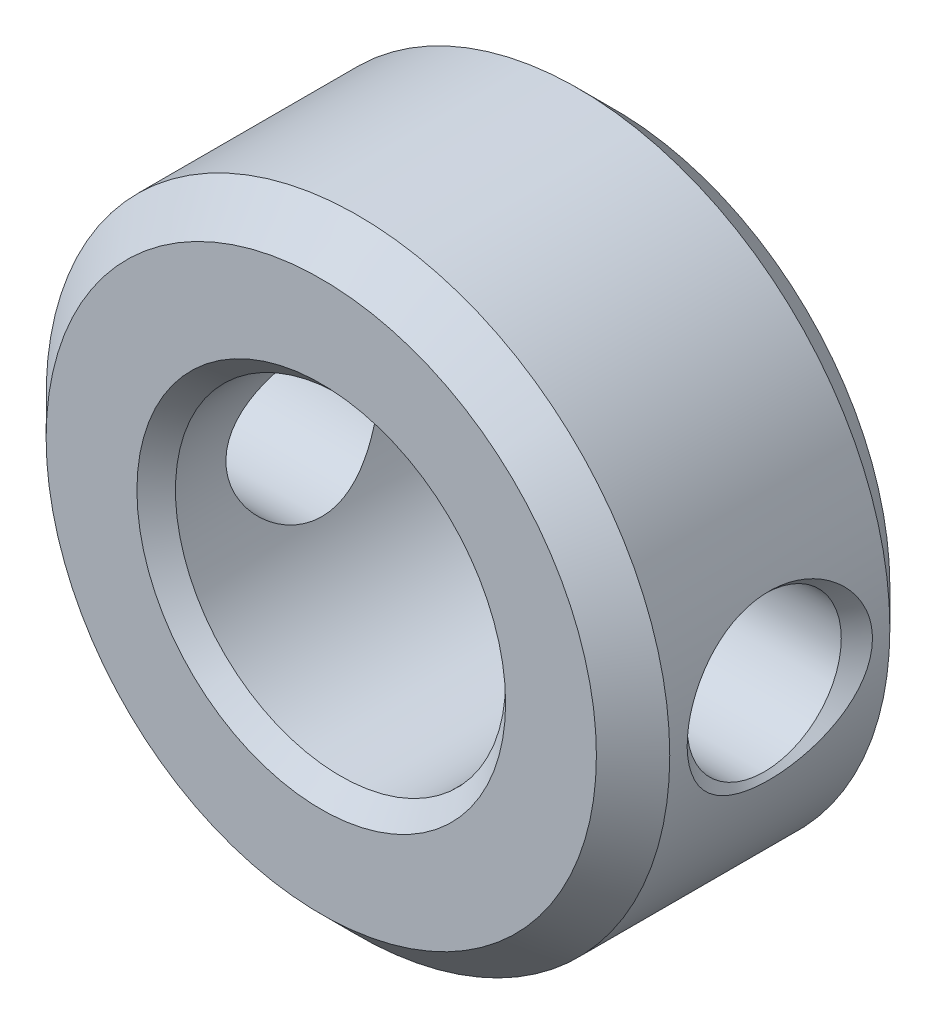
ISO-10303-21;
HEADER;
FILE_DESCRIPTION(('STEP AP214'),'2;1');
FILE_NAME('part.step','',(''),(''),'','','');
FILE_SCHEMA(('AUTOMOTIVE_DESIGN { 1 0 10303 214 1 1 1 1 }'));
ENDSEC;
DATA;
#1=APPLICATION_CONTEXT('core data for automotive mechanical design processes');
#2=APPLICATION_PROTOCOL_DEFINITION('international standard','automotive_design',2000,#1);
#3=PRODUCT_CONTEXT('',#1,'mechanical');
#4=PRODUCT('Part','Part','',(#3));
#5=PRODUCT_RELATED_PRODUCT_CATEGORY('part','',(#4));
#6=PRODUCT_DEFINITION_FORMATION('','',#4);
#7=PRODUCT_DEFINITION_CONTEXT('part definition',#1,'design');
#8=PRODUCT_DEFINITION('design','',#6,#7);
#9=PRODUCT_DEFINITION_SHAPE('','',#8);
#10=(LENGTH_UNIT() NAMED_UNIT(*) SI_UNIT(.MILLI.,.METRE.));
#11=(NAMED_UNIT(*) PLANE_ANGLE_UNIT() SI_UNIT($,.RADIAN.));
#12=(NAMED_UNIT(*) SI_UNIT($,.STERADIAN.) SOLID_ANGLE_UNIT());
#13=UNCERTAINTY_MEASURE_WITH_UNIT(LENGTH_MEASURE(1.E-05),#10,'distance_accuracy_value','');
#14=(GEOMETRIC_REPRESENTATION_CONTEXT(3) GLOBAL_UNCERTAINTY_ASSIGNED_CONTEXT((#13)) GLOBAL_UNIT_ASSIGNED_CONTEXT((#10,
#11,#12)) REPRESENTATION_CONTEXT('',''));
#15=CARTESIAN_POINT('',(0.,0.,0.));
#16=DIRECTION('',(0.,0.,1.));
#17=DIRECTION('',(1.,0.,0.));
#18=AXIS2_PLACEMENT_3D('',#15,#16,#17);
#19=CARTESIAN_POINT('',(0.,0.,8.));
#20=DIRECTION('',(0.,0.,-1.));
#21=DIRECTION('',(-1.,0.,0.));
#22=AXIS2_PLACEMENT_3D('',#19,#20,#21);
#23=CYLINDRICAL_SURFACE('',#22,8.5);
#24=CARTESIAN_POINT('',(-8.33916599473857,-1.64569455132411,2.30265787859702));
#25=CARTESIAN_POINT('',(-8.35352873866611,-1.5729086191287,2.21207653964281));
#26=CARTESIAN_POINT('',(-8.3681653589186,-1.49374170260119,2.1266935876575));
#27=CARTESIAN_POINT('',(-8.39677857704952,-1.32346522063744,1.96856182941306));
#28=CARTESIAN_POINT('',(-8.41075510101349,-1.23235432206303,1.89581443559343));
#29=CARTESIAN_POINT('',(-8.43857211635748,-1.02604069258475,1.75639125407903));
#30=CARTESIAN_POINT('',(-8.4521224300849,-0.909249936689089,1.69197300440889));
#31=CARTESIAN_POINT('',(-8.47482320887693,-0.665078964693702,1.58664198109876));
#32=CARTESIAN_POINT('',(-8.48397688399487,-0.537706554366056,1.54571205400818));
#33=CARTESIAN_POINT('',(-8.49568512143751,-0.293768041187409,1.49380051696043));
#34=CARTESIAN_POINT('',(-8.49893425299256,-0.177904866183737,1.47965677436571));
#35=CARTESIAN_POINT('',(-8.50061776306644,0.0544897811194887,1.47229961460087));
#36=CARTESIAN_POINT('',(-8.49905475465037,0.171020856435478,1.47907483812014));
#37=CARTESIAN_POINT('',(-8.49162408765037,0.391923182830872,1.51177200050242));
#38=CARTESIAN_POINT('',(-8.48609914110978,0.496537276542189,1.53617064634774));
#39=CARTESIAN_POINT('',(-8.47171529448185,0.700345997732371,1.6011473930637));
#40=CARTESIAN_POINT('',(-8.46285597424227,0.799539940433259,1.64172753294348));
#41=CARTESIAN_POINT('',(-8.44222788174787,0.99438229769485,1.73932031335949));
#42=CARTESIAN_POINT('',(-8.4303529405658,1.08970901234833,1.79694912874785));
#43=CARTESIAN_POINT('',(-8.40500514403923,1.27052787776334,1.925667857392));
#44=CARTESIAN_POINT('',(-8.39153164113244,1.35601601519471,1.99676323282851));
#45=CARTESIAN_POINT('',(-8.36245668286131,1.52564530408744,2.15947500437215));
#46=CARTESIAN_POINT('',(-8.34679383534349,1.60839490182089,2.25252997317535));
#47=CARTESIAN_POINT('',(-8.31632879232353,1.75914786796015,2.45001940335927));
#48=CARTESIAN_POINT('',(-8.30152704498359,1.82714360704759,2.55445971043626));
#49=CARTESIAN_POINT('',(-8.27235638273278,1.95524349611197,2.78582569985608));
#50=CARTESIAN_POINT('',(-8.25827400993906,2.01329177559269,2.91392914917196));
#51=CARTESIAN_POINT('',(-8.23432846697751,2.10909388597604,3.17788487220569));
#52=CARTESIAN_POINT('',(-8.22446670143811,2.1468409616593,3.31373970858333));
#53=CARTESIAN_POINT('',(-8.20948285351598,2.20348191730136,3.59970989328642));
#54=CARTESIAN_POINT('',(-8.20474827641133,2.22084191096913,3.75015184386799));
#55=CARTESIAN_POINT('',(-8.2018842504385,2.23139451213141,4.05194839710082));
#56=CARTESIAN_POINT('',(-8.20375569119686,2.2245838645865,4.20330311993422));
#57=CARTESIAN_POINT('',(-8.2139681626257,2.18657738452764,4.50537141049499));
#58=CARTESIAN_POINT('',(-8.2224202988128,2.1549627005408,4.65602882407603));
#59=CARTESIAN_POINT('',(-8.24488809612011,2.06732983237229,4.9496862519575));
#60=CARTESIAN_POINT('',(-8.25890484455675,2.01130687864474,5.09268476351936));
#61=CARTESIAN_POINT('',(-8.29061921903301,1.87626998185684,5.3654383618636));
#62=CARTESIAN_POINT('',(-8.30828426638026,1.79745721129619,5.49529645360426));
#63=CARTESIAN_POINT('',(-8.34512776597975,1.6177832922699,5.73862022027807));
#64=CARTESIAN_POINT('',(-8.36430600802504,1.51692520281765,5.85208816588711));
#65=CARTESIAN_POINT('',(-8.40035838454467,1.30195396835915,6.05111571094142));
#66=CARTESIAN_POINT('',(-8.41730160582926,1.18906458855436,6.13797706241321));
#67=CARTESIAN_POINT('',(-8.44781674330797,0.948172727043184,6.28815050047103));
#68=CARTESIAN_POINT('',(-8.46139330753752,0.820191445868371,6.35149511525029));
#69=CARTESIAN_POINT('',(-8.48155598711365,0.571495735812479,6.4436182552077));
#70=CARTESIAN_POINT('',(-8.48883938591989,0.452141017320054,6.47591403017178));
#71=CARTESIAN_POINT('',(-8.49828718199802,0.209320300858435,6.51759305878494));
#72=CARTESIAN_POINT('',(-8.50045611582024,0.0858580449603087,6.52699661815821));
#73=CARTESIAN_POINT('',(-8.49944227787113,-0.146246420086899,6.52256027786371));
#74=CARTESIAN_POINT('',(-8.49685000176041,-0.254949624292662,6.51128523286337));
#75=CARTESIAN_POINT('',(-8.48773555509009,-0.46882759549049,6.47100322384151));
#76=CARTESIAN_POINT('',(-8.48121350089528,-0.574002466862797,6.44199678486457));
#77=CARTESIAN_POINT('',(-8.46494812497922,-0.777887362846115,6.36778750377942));
#78=CARTESIAN_POINT('',(-8.4552119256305,-0.876611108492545,6.32262045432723));
#79=CARTESIAN_POINT('',(-8.43344706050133,-1.06586094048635,6.2179912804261));
#80=CARTESIAN_POINT('',(-8.42141769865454,-1.15638452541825,6.15852481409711));
#81=CARTESIAN_POINT('',(-8.39484147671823,-1.33630523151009,6.02083970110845));
#82=CARTESIAN_POINT('',(-8.38016330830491,-1.42470695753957,5.94134864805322));
#83=CARTESIAN_POINT('',(-8.35062594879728,-1.58871150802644,5.77015442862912));
#84=CARTESIAN_POINT('',(-8.33576666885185,-1.66430775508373,5.67844502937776));
#85=CARTESIAN_POINT('',(-8.30522068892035,-1.81098056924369,5.47242335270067));
#86=CARTESIAN_POINT('',(-8.28968350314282,-1.88014472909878,5.35672534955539));
#87=CARTESIAN_POINT('',(-8.26153023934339,-2.00023201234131,5.11589355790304));
#88=CARTESIAN_POINT('',(-8.24891541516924,-2.05114731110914,4.99075574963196));
#89=CARTESIAN_POINT('',(-8.22683212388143,-2.13809652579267,4.72178245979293));
#90=CARTESIAN_POINT('',(-8.21777804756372,-2.17224994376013,4.57730157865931));
#91=CARTESIAN_POINT('',(-8.20570254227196,-2.21742946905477,4.28452395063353));
#92=CARTESIAN_POINT('',(-8.20268205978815,-2.22845194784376,4.13622660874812));
#93=CARTESIAN_POINT('',(-8.20303142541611,-2.22716985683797,3.83477619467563));
#94=CARTESIAN_POINT('',(-8.20661759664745,-2.21407563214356,3.68162600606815));
#95=CARTESIAN_POINT('',(-8.22017248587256,-2.16320292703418,3.37971438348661));
#96=CARTESIAN_POINT('',(-8.23014325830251,-2.12541650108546,3.23095437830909));
#97=CARTESIAN_POINT('',(-8.2550259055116,-2.02659491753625,2.94460968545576));
#98=CARTESIAN_POINT('',(-8.26985217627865,-1.96595997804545,2.80687949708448));
#99=CARTESIAN_POINT('',(-8.30269228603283,-1.8222810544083,2.54413064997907));
#100=CARTESIAN_POINT('',(-8.32070285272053,-1.73926002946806,2.4190991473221));
#101=CARTESIAN_POINT('',(-8.33916599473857,-1.64569455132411,2.30265787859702));
#102=B_SPLINE_CURVE_WITH_KNOTS('',3,(#24,#25,#26,#27,#28,#29,#30,#31,#32,#33,#34,#35,#36,#37,
#38,#39,#40,#41,#42,#43,#44,#45,#46,#47,#48,#49,#50,#51,#52,#53,#54,#55,#56,#57,#58,#59,#60,#61,
#62,#63,#64,#65,#66,#67,#68,#69,#70,#71,#72,#73,#74,#75,#76,#77,#78,#79,#80,#81,#82,#83,#84,#85,
#86,#87,#88,#89,#90,#91,#92,#93,#94,#95,#96,#97,#98,#99,#100,#101),.UNSPECIFIED.,.T.,.F.,(4,2,2,
2,2,2,2,2,2,2,2,2,2,2,2,2,2,2,2,2,2,2,2,2,2,2,2,2,2,2,2,2,2,2,2,2,2,2,4),(0.,0.350889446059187,
0.701818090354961,1.10163292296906,1.50115539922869,1.84955245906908,2.1977603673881,
2.51900407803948,2.84028828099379,3.1750070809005,3.50986193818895,3.88488231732,
4.26009616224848,4.68231700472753,5.10467825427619,5.55711480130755,6.00961227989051,
6.46991971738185,6.93031714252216,7.38676847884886,7.84315651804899,8.27099653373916,
8.69824253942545,9.06768093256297,9.43679150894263,9.76317028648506,10.0895394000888,
10.4151900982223,10.7409398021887,11.0988814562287,11.4570064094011,11.8623836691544,
12.2679345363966,12.7121325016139,13.1564001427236,13.6154737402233,14.0746951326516,
14.5262208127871,14.9772851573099),.UNSPECIFIED.);
#103=CARTESIAN_POINT('',(-8.33916599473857,-1.64569455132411,2.30265787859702));
#104=VERTEX_POINT('',#103);
#105=EDGE_CURVE('E10',#104,#104,#102,.T.);
#106=ORIENTED_EDGE('',*,*,#105,.T.);
#107=EDGE_LOOP('',(#106));
#108=FACE_BOUND('',#107,.T.);
#109=CARTESIAN_POINT('',(8.33916599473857,-1.64569455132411,2.30265787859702));
#110=CARTESIAN_POINT('',(8.32127794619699,-1.73634425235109,2.41547345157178));
#111=CARTESIAN_POINT('',(8.30380406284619,-1.81714361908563,2.53641819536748));
#112=CARTESIAN_POINT('',(8.27177387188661,-1.95780224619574,2.79042727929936));
#113=CARTESIAN_POINT('',(8.25722301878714,-2.01762251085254,2.92351361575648));
#114=CARTESIAN_POINT('',(8.23266216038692,-2.11561918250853,3.19848990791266));
#115=CARTESIAN_POINT('',(8.2226722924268,-2.15369978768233,3.34041582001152));
#116=CARTESIAN_POINT('',(8.20846300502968,-2.20723965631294,3.62867161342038));
#117=CARTESIAN_POINT('',(8.20424118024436,-2.22270834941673,3.77499963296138));
#118=CARTESIAN_POINT('',(8.20199379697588,-2.23099291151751,4.07462232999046));
#119=CARTESIAN_POINT('',(8.20424057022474,-2.22281310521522,4.22794764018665));
#120=CARTESIAN_POINT('',(8.21525179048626,-2.18176072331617,4.53105918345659));
#121=CARTESIAN_POINT('',(8.22401807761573,-2.1488811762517,4.6808444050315));
#122=CARTESIAN_POINT('',(8.24702307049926,-2.0588264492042,4.97294209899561));
#123=CARTESIAN_POINT('',(8.26127623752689,-2.00158702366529,5.11523368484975));
#124=CARTESIAN_POINT('',(8.29348701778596,-1.86361847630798,5.38757095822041));
#125=CARTESIAN_POINT('',(8.3114451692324,-1.78288594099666,5.51761486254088));
#126=CARTESIAN_POINT('',(8.34817658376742,-1.60193489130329,5.7570676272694));
#127=CARTESIAN_POINT('',(8.36690868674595,-1.50238060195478,5.86698217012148));
#128=CARTESIAN_POINT('',(8.40317350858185,-1.28407651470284,6.06606361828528));
#129=CARTESIAN_POINT('',(8.4207072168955,-1.16534283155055,6.15524778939));
#130=CARTESIAN_POINT('',(8.45027465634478,-0.925148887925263,6.29965357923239));
#131=CARTESIAN_POINT('',(8.46269375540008,-0.805302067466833,6.3574679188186));
#132=CARTESIAN_POINT('',(8.48268860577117,-0.556320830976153,6.44876014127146));
#133=CARTESIAN_POINT('',(8.49027101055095,-0.427199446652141,6.48227146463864));
#134=CARTESIAN_POINT('',(8.4987763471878,-0.183210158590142,6.51970221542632));
#135=CARTESIAN_POINT('',(8.50048740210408,-0.0688990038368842,6.52712734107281));
#136=CARTESIAN_POINT('',(8.4992726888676,0.159214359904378,6.52182503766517));
#137=CARTESIAN_POINT('',(8.49634841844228,0.273016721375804,6.50910411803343));
#138=CARTESIAN_POINT('',(8.48653649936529,0.489651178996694,6.46566368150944));
#139=CARTESIAN_POINT('',(8.47990160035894,0.592728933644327,6.43608987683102));
#140=CARTESIAN_POINT('',(8.46354655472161,0.792754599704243,6.36130106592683));
#141=CARTESIAN_POINT('',(8.45382592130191,0.889701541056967,6.31608359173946));
#142=CARTESIAN_POINT('',(8.4315686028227,1.08095382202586,6.20881138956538));
#143=CARTESIAN_POINT('',(8.41890116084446,1.17477878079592,6.14593134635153));
#144=CARTESIAN_POINT('',(8.39228289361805,1.35189703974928,6.00702178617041));
#145=CARTESIAN_POINT('',(8.37833150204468,1.43518565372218,5.93098645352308));
#146=CARTESIAN_POINT('',(8.34853354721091,1.59995614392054,5.75771910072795));
#147=CARTESIAN_POINT('',(8.33266911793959,1.67989606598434,5.65902415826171));
#148=CARTESIAN_POINT('',(8.30227558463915,1.82418937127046,5.45065301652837));
#149=CARTESIAN_POINT('',(8.28774715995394,1.88853485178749,5.34097128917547));
#150=CARTESIAN_POINT('',(8.25974065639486,2.0077068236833,5.09960644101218));
#151=CARTESIAN_POINT('',(8.24659695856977,2.06046924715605,4.96686174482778));
#152=CARTESIAN_POINT('',(8.2250392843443,2.14490820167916,4.69446147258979));
#153=CARTESIAN_POINT('',(8.21662667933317,2.17657861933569,4.5548039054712));
#154=CARTESIAN_POINT('',(8.20509883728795,2.21966241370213,4.26340623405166));
#155=CARTESIAN_POINT('',(8.20233892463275,2.22971890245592,4.11144945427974));
#156=CARTESIAN_POINT('',(8.20351085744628,2.2254009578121,3.80790122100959));
#157=CARTESIAN_POINT('',(8.20744357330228,2.2110233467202,3.65630981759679));
#158=CARTESIAN_POINT('',(8.22161146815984,2.15774655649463,3.35587084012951));
#159=CARTESIAN_POINT('',(8.23192302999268,2.11855004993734,3.20707938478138));
#160=CARTESIAN_POINT('',(8.25764410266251,2.01596029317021,2.91848897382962));
#161=CARTESIAN_POINT('',(8.2730546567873,1.95256209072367,2.77869186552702));
#162=CARTESIAN_POINT('',(8.30680996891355,1.80351171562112,2.51436152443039));
#163=CARTESIAN_POINT('',(8.3251123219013,1.7181714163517,2.38964775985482));
#164=CARTESIAN_POINT('',(8.36244709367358,1.52610982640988,2.1579460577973));
#165=CARTESIAN_POINT('',(8.3814792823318,1.41939523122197,2.05095258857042));
#166=CARTESIAN_POINT('',(8.41621634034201,1.19546666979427,1.86704121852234));
#167=CARTESIAN_POINT('',(8.43206371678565,1.07964122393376,1.78846906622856));
#168=CARTESIAN_POINT('',(8.45983079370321,0.834490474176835,1.6553898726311));
#169=CARTESIAN_POINT('',(8.47175620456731,0.705185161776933,1.60084780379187));
#170=CARTESIAN_POINT('',(8.48851476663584,0.456518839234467,1.52538194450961));
#171=CARTESIAN_POINT('',(8.49410895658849,0.338313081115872,1.50081152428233));
#172=CARTESIAN_POINT('',(8.50025780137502,0.0992924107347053,1.47383898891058));
#173=CARTESIAN_POINT('',(8.50081616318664,-0.0215205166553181,1.47142056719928));
#174=CARTESIAN_POINT('',(8.49703371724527,-0.249108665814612,1.48797486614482));
#175=CARTESIAN_POINT('',(8.49318739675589,-0.356057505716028,1.50478831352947));
#176=CARTESIAN_POINT('',(8.48180873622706,-0.565629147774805,1.55546676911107));
#177=CARTESIAN_POINT('',(8.47427562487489,-0.668251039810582,1.58933534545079));
#178=CARTESIAN_POINT('',(8.45613513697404,-0.868366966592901,1.67322863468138));
#179=CARTESIAN_POINT('',(8.44547802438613,-0.965745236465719,1.72351635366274));
#180=CARTESIAN_POINT('',(8.42215230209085,-1.15157551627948,1.83801083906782));
#181=CARTESIAN_POINT('',(8.40948456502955,-1.24003137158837,1.90221157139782));
#182=CARTESIAN_POINT('',(8.3870478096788,-1.38239130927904,2.02191212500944));
#183=CARTESIAN_POINT('',(8.37751289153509,-1.43884079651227,2.07447588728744));
#184=CARTESIAN_POINT('',(8.35833483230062,-1.54635617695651,2.18481061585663));
#185=CARTESIAN_POINT('',(8.34869169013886,-1.59742201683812,2.2425816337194));
#186=CARTESIAN_POINT('',(8.33916599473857,-1.64569455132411,2.30265787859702));
#187=B_SPLINE_CURVE_WITH_KNOTS('',3,(#109,#110,#111,#112,#113,#114,#115,#116,#117,#118,#119,
#120,#121,#122,#123,#124,#125,#126,#127,#128,#129,#130,#131,#132,#133,#134,#135,#136,#137,#138,
#139,#140,#141,#142,#143,#144,#145,#146,#147,#148,#149,#150,#151,#152,#153,#154,#155,#156,#157,
#158,#159,#160,#161,#162,#163,#164,#165,#166,#167,#168,#169,#170,#171,#172,#173,#174,#175,#176,
#177,#178,#179,#180,#181,#182,#183,#184,#185,#186),.UNSPECIFIED.,.T.,.F.,(4,2,2,2,2,2,2,2,2,2,2,
2,2,2,2,2,2,2,2,2,2,2,2,2,2,2,2,2,2,2,2,2,2,2,2,2,2,2,4),(0.,0.437184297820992,
0.875176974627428,1.31508517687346,1.75480987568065,2.21331441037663,2.67194840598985,
3.13179955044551,3.59171754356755,4.03770605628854,4.48332177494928,4.88185689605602,
5.27984259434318,5.62172259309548,5.96349214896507,6.28440566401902,6.60536982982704,
6.94497390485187,7.28472849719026,7.66717300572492,8.0498109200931,8.47829198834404,
8.90689719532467,9.36170706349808,9.81657608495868,10.2770002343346,10.7375186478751,
11.191822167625,11.6459835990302,12.0660692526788,12.4855405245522,12.846077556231,
13.2063491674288,13.5298293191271,13.8533771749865,14.1823852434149,14.5112509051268,
14.7440568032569,14.9768650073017),.UNSPECIFIED.);
#188=CARTESIAN_POINT('',(8.33916599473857,-1.64569455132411,2.30265787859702));
#189=VERTEX_POINT('',#188);
#190=EDGE_CURVE('E44',#189,#189,#187,.T.);
#191=ORIENTED_EDGE('',*,*,#190,.T.);
#192=EDGE_LOOP('',(#191));
#193=FACE_BOUND('',#192,.T.);
#194=CARTESIAN_POINT('',(0.,0.,1.));
#195=DIRECTION('',(0.,0.,1.));
#196=DIRECTION('',(1.,0.,0.));
#197=AXIS2_PLACEMENT_3D('',#194,#195,#196);
#198=CIRCLE('',#197,8.5);
#199=CARTESIAN_POINT('',(8.5,0.,1.));
#200=VERTEX_POINT('',#199);
#201=EDGE_CURVE('E94',#200,#200,#198,.T.);
#202=ORIENTED_EDGE('',*,*,#201,.T.);
#203=EDGE_LOOP('',(#202));
#204=FACE_BOUND('',#203,.T.);
#205=CARTESIAN_POINT('',(0.,0.,7.));
#206=DIRECTION('',(0.,0.,1.));
#207=DIRECTION('',(1.,0.,0.));
#208=AXIS2_PLACEMENT_3D('',#205,#206,#207);
#209=CIRCLE('',#208,8.5);
#210=CARTESIAN_POINT('',(8.5,0.,7.));
#211=VERTEX_POINT('',#210);
#212=EDGE_CURVE('E88',#211,#211,#209,.F.);
#213=ORIENTED_EDGE('',*,*,#212,.T.);
#214=EDGE_LOOP('',(#213));
#215=FACE_BOUND('',#214,.T.);
#216=ADVANCED_FACE('F32',(#108,#193,#204,#215),#23,.T.);
#217=CARTESIAN_POINT('',(0.,0.,8.));
#218=DIRECTION('',(0.,0.,1.));
#219=DIRECTION('',(1.,0.,0.));
#220=AXIS2_PLACEMENT_3D('',#217,#218,#219);
#221=PLANE('',#220);
#222=CARTESIAN_POINT('',(0.,0.,8.));
#223=DIRECTION('',(0.,0.,1.));
#224=DIRECTION('',(1.,0.,0.));
#225=AXIS2_PLACEMENT_3D('',#222,#223,#224);
#226=CIRCLE('',#225,5.025);
#227=CARTESIAN_POINT('',(5.025,0.,8.));
#228=VERTEX_POINT('',#227);
#229=EDGE_CURVE('E107',#228,#228,#226,.T.);
#230=ORIENTED_EDGE('',*,*,#229,.F.);
#231=EDGE_LOOP('',(#230));
#232=FACE_BOUND('',#231,.T.);
#233=CARTESIAN_POINT('',(0.,0.,8.));
#234=DIRECTION('',(0.,0.,1.));
#235=DIRECTION('',(1.,0.,0.));
#236=AXIS2_PLACEMENT_3D('',#233,#234,#235);
#237=CIRCLE('',#236,7.50000000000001);
#238=CARTESIAN_POINT('',(7.50000000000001,0.,8.));
#239=VERTEX_POINT('',#238);
#240=EDGE_CURVE('E48',#239,#239,#237,.T.);
#241=ORIENTED_EDGE('',*,*,#240,.T.);
#242=EDGE_LOOP('',(#241));
#243=FACE_BOUND('',#242,.T.);
#244=ADVANCED_FACE('F62',(#232,#243),#221,.T.);
#245=CARTESIAN_POINT('',(0.,0.,0.));
#246=DIRECTION('',(0.,0.,1.));
#247=DIRECTION('',(1.,0.,0.));
#248=AXIS2_PLACEMENT_3D('',#245,#246,#247);
#249=PLANE('',#248);
#250=CARTESIAN_POINT('',(0.,0.,0.));
#251=DIRECTION('',(0.,0.,1.));
#252=DIRECTION('',(1.,0.,0.));
#253=AXIS2_PLACEMENT_3D('',#250,#251,#252);
#254=CIRCLE('',#253,5.025);
#255=CARTESIAN_POINT('',(5.025,0.,0.));
#256=VERTEX_POINT('',#255);
#257=EDGE_CURVE('E110',#256,#256,#254,.T.);
#258=ORIENTED_EDGE('',*,*,#257,.T.);
#259=EDGE_LOOP('',(#258));
#260=FACE_BOUND('',#259,.T.);
#261=CARTESIAN_POINT('',(0.,0.,0.));
#262=DIRECTION('',(0.,0.,1.));
#263=DIRECTION('',(1.,0.,0.));
#264=AXIS2_PLACEMENT_3D('',#261,#262,#263);
#265=CIRCLE('',#264,7.5);
#266=CARTESIAN_POINT('',(7.5,0.,0.));
#267=VERTEX_POINT('',#266);
#268=EDGE_CURVE('E92',#267,#267,#265,.F.);
#269=ORIENTED_EDGE('',*,*,#268,.T.);
#270=EDGE_LOOP('',(#269));
#271=FACE_BOUND('',#270,.T.);
#272=ADVANCED_FACE('F63',(#260,#271),#249,.F.);
#273=CARTESIAN_POINT('',(0.,0.,1.));
#274=DIRECTION('',(0.,0.,1.));
#275=DIRECTION('',(1.,0.,0.));
#276=AXIS2_PLACEMENT_3D('',#273,#274,#275);
#277=CONICAL_SURFACE('',#276,8.5,0.785398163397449);
#278=ORIENTED_EDGE('',*,*,#268,.F.);
#279=EDGE_LOOP('',(#278));
#280=FACE_BOUND('',#279,.T.);
#281=ORIENTED_EDGE('',*,*,#201,.F.);
#282=EDGE_LOOP('',(#281));
#283=FACE_BOUND('',#282,.T.);
#284=ADVANCED_FACE('F65',(#280,#283),#277,.T.);
#285=CARTESIAN_POINT('',(0.,0.,8.));
#286=DIRECTION('',(0.,0.,-1.));
#287=DIRECTION('',(-1.,0.,0.));
#288=AXIS2_PLACEMENT_3D('',#285,#286,#287);
#289=CONICAL_SURFACE('',#288,7.50000000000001,0.785398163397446);
#290=ORIENTED_EDGE('',*,*,#212,.F.);
#291=EDGE_LOOP('',(#290));
#292=FACE_BOUND('',#291,.T.);
#293=ORIENTED_EDGE('',*,*,#240,.F.);
#294=EDGE_LOOP('',(#293));
#295=FACE_BOUND('',#294,.T.);
#296=ADVANCED_FACE('F73',(#292,#295),#289,.T.);
#297=CARTESIAN_POINT('',(0.,0.,0.524999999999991));
#298=DIRECTION('',(0.,0.,-1.));
#299=DIRECTION('',(-1.,0.,0.));
#300=AXIS2_PLACEMENT_3D('',#297,#298,#299);
#301=CONICAL_SURFACE('',#300,4.49999999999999,0.785398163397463);
#302=ORIENTED_EDGE('',*,*,#257,.F.);
#303=EDGE_LOOP('',(#302));
#304=FACE_BOUND('',#303,.T.);
#305=CARTESIAN_POINT('',(0.,0.,0.524999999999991));
#306=DIRECTION('',(0.,0.,1.));
#307=DIRECTION('',(1.,0.,0.));
#308=AXIS2_PLACEMENT_3D('',#305,#306,#307);
#309=CIRCLE('',#308,4.49999999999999);
#310=CARTESIAN_POINT('',(4.49999999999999,0.,0.524999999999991));
#311=VERTEX_POINT('',#310);
#312=EDGE_CURVE('E101',#311,#311,#309,.T.);
#313=ORIENTED_EDGE('',*,*,#312,.T.);
#314=EDGE_LOOP('',(#313));
#315=FACE_BOUND('',#314,.T.);
#316=ADVANCED_FACE('F75',(#304,#315),#301,.F.);
#317=CARTESIAN_POINT('',(0.,0.,8.));
#318=DIRECTION('',(0.,0.,1.));
#319=DIRECTION('',(1.,0.,0.));
#320=AXIS2_PLACEMENT_3D('',#317,#318,#319);
#321=CYLINDRICAL_SURFACE('',#320,4.49999999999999);
#322=CARTESIAN_POINT('',(-4.49999999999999,0.,1.90000000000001));
#323=CARTESIAN_POINT('',(-4.49999489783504,-0.111264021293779,1.9000060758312));
#324=CARTESIAN_POINT('',(-4.49582799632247,-0.222686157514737,1.90889473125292));
#325=CARTESIAN_POINT('',(-4.47957199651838,-0.442291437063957,1.94408163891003));
#326=CARTESIAN_POINT('',(-4.46746534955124,-0.55046684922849,1.97041845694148));
#327=CARTESIAN_POINT('',(-4.43660817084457,-0.760057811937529,2.03927763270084));
#328=CARTESIAN_POINT('',(-4.41788225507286,-0.861496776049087,2.08174006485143));
#329=CARTESIAN_POINT('',(-4.37554769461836,-1.05568597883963,2.18136145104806));
#330=CARTESIAN_POINT('',(-4.35193986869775,-1.14843767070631,2.23851794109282));
#331=CARTESIAN_POINT('',(-4.30055265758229,-1.32833402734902,2.36948602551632));
#332=CARTESIAN_POINT('',(-4.27261570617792,-1.41489428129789,2.44403775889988));
#333=CARTESIAN_POINT('',(-4.21629940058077,-1.57480810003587,2.60610128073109));
#334=CARTESIAN_POINT('',(-4.18791976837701,-1.64815296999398,2.69362153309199));
#335=CARTESIAN_POINT('',(-4.13182329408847,-1.78432392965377,2.88601550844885));
#336=CARTESIAN_POINT('',(-4.10427039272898,-1.84615201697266,2.99164873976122));
#337=CARTESIAN_POINT('',(-4.05553006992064,-1.95090689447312,3.21326250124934));
#338=CARTESIAN_POINT('',(-4.03433858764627,-1.99384575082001,3.32923636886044));
#339=CARTESIAN_POINT('',(-4.00246921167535,-2.05704583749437,3.5615630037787));
#340=CARTESIAN_POINT('',(-3.99127033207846,-2.07843946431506,3.67753302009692));
#341=CARTESIAN_POINT('',(-3.97920979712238,-2.1014464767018,3.91191423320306));
#342=CARTESIAN_POINT('',(-3.978340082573,-2.1030752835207,4.03032345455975));
#343=CARTESIAN_POINT('',(-3.98660720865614,-2.08734488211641,4.25342826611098));
#344=CARTESIAN_POINT('',(-3.99474416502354,-2.07188323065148,4.35830301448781));
#345=CARTESIAN_POINT('',(-4.01838155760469,-2.02565458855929,4.56375111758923));
#346=CARTESIAN_POINT('',(-4.03388388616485,-1.99488366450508,4.66432335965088));
#347=CARTESIAN_POINT('',(-4.07086385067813,-1.9183074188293,4.86110828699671));
#348=CARTESIAN_POINT('',(-4.09247103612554,-1.87217176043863,4.95716695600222));
#349=CARTESIAN_POINT('',(-4.13921554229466,-1.76641808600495,5.14060899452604));
#350=CARTESIAN_POINT('',(-4.1643544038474,-1.70679417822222,5.22798854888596));
#351=CARTESIAN_POINT('',(-4.21863777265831,-1.56818654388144,5.401580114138));
#352=CARTESIAN_POINT('',(-4.24792084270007,-1.48780370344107,5.48663528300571));
#353=CARTESIAN_POINT('',(-4.30494408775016,-1.3137140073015,5.64250174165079));
#354=CARTESIAN_POINT('',(-4.33268369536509,-1.22000229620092,5.71330781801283));
#355=CARTESIAN_POINT('',(-4.38471347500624,-1.01763010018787,5.84098788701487));
#356=CARTESIAN_POINT('',(-4.40884559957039,-0.908556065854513,5.89727584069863));
#357=CARTESIAN_POINT('',(-4.44965784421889,-0.681071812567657,5.99027907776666));
#358=CARTESIAN_POINT('',(-4.46634314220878,-0.562668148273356,6.02700796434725));
#359=CARTESIAN_POINT('',(-4.48933753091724,-0.329445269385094,6.07716307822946));
#360=CARTESIAN_POINT('',(-4.49633267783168,-0.215026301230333,6.09213423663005));
#361=CARTESIAN_POINT('',(-4.50144196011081,0.0148973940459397,6.10309500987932));
#362=CARTESIAN_POINT('',(-4.49955954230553,0.130401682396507,6.09909199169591));
#363=CARTESIAN_POINT('',(-4.48754815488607,0.351207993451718,6.07321034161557));
#364=CARTESIAN_POINT('',(-4.47796715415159,0.456682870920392,6.05251918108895));
#365=CARTESIAN_POINT('',(-4.45217548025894,0.662492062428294,5.9956220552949));
#366=CARTESIAN_POINT('',(-4.43596403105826,0.762825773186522,5.95941427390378));
#367=CARTESIAN_POINT('',(-4.39779273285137,0.959019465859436,5.87141590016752));
#368=CARTESIAN_POINT('',(-4.37567194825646,1.05464812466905,5.81918177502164));
#369=CARTESIAN_POINT('',(-4.32791192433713,1.23612200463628,5.70109835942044));
#370=CARTESIAN_POINT('',(-4.30227114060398,1.32196290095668,5.63524308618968));
#371=CARTESIAN_POINT('',(-4.24736892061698,1.4893908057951,5.48507413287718));
#372=CARTESIAN_POINT('',(-4.2179872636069,1.56994232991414,5.39964737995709));
#373=CARTESIAN_POINT('',(-4.16072568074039,1.71596232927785,5.21623307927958));
#374=CARTESIAN_POINT('',(-4.13284647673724,1.78142360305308,5.11823956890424));
#375=CARTESIAN_POINT('',(-4.080979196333,1.89730888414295,4.90831939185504));
#376=CARTESIAN_POINT('',(-4.05714661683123,1.94717643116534,4.79604395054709));
#377=CARTESIAN_POINT('',(-4.01797403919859,2.02679215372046,4.5632109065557));
#378=CARTESIAN_POINT('',(-4.00262464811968,2.05656258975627,4.44266263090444));
#379=CARTESIAN_POINT('',(-3.98384794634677,2.09268542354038,4.20838667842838));
#380=CARTESIAN_POINT('',(-3.97947067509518,2.10090687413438,4.09502370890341));
#381=CARTESIAN_POINT('',(-3.98051230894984,2.09893489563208,3.868519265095));
#382=CARTESIAN_POINT('',(-3.98592846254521,2.08874663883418,3.75537773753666));
#383=CARTESIAN_POINT('',(-4.00499231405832,2.05192858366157,3.54114990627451));
#384=CARTESIAN_POINT('',(-4.01801114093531,2.02655153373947,3.43978606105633));
#385=CARTESIAN_POINT('',(-4.05017159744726,1.96148398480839,3.24280257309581));
#386=CARTESIAN_POINT('',(-4.06931505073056,1.92178922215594,3.14718465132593));
#387=CARTESIAN_POINT('',(-4.1131290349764,1.82622609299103,2.95744518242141));
#388=CARTESIAN_POINT('',(-4.13808167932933,1.76946057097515,2.86384228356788));
#389=CARTESIAN_POINT('',(-4.19011071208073,1.6424613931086,2.68691527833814));
#390=CARTESIAN_POINT('',(-4.21718808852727,1.5722214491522,2.60359600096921));
#391=CARTESIAN_POINT('',(-4.27367263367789,1.41196152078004,2.4409395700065));
#392=CARTESIAN_POINT('',(-4.30304091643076,1.32066391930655,2.36284111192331));
#393=CARTESIAN_POINT('',(-4.35820998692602,1.12529862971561,2.22288485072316));
#394=CARTESIAN_POINT('',(-4.38400907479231,1.02122490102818,2.16103477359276));
#395=CARTESIAN_POINT('',(-4.42908822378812,0.803416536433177,2.05601875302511));
#396=CARTESIAN_POINT('',(-4.4484023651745,0.68973646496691,2.01275478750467));
#397=CARTESIAN_POINT('',(-4.47840544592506,0.455734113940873,1.94646588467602));
#398=CARTESIAN_POINT('',(-4.48912004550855,0.335432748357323,1.92338071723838));
#399=CARTESIAN_POINT('',(-4.49660167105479,0.178484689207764,1.90729147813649));
#400=CARTESIAN_POINT('',(-4.49787348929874,0.142859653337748,1.90456014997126));
#401=CARTESIAN_POINT('',(-4.49957348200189,0.0714951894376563,1.90091341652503));
#402=CARTESIAN_POINT('',(-4.50000163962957,0.035755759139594,1.89999804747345));
#403=CARTESIAN_POINT('',(-4.49999999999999,0.,1.90000000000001));
#404=B_SPLINE_CURVE_WITH_KNOTS('',3,(#322,#323,#324,#325,#326,#327,#328,#329,#330,#331,#332,
#333,#334,#335,#336,#337,#338,#339,#340,#341,#342,#343,#344,#345,#346,#347,#348,#349,#350,#351,
#352,#353,#354,#355,#356,#357,#358,#359,#360,#361,#362,#363,#364,#365,#366,#367,#368,#369,#370,
#371,#372,#373,#374,#375,#376,#377,#378,#379,#380,#381,#382,#383,#384,#385,#386,#387,#388,#389,
#390,#391,#392,#393,#394,#395,#396,#397,#398,#399,#400,#401,#402,#403),.UNSPECIFIED.,.T.,.F.,(4,
2,2,2,2,2,2,2,2,2,2,2,2,2,2,2,2,2,2,2,2,2,2,2,2,2,2,2,2,2,2,2,2,2,2,2,2,2,2,2,4),(0.,
0.333645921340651,0.668031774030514,1.00118696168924,1.33428631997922,1.68561012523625,
2.03716424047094,2.41164643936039,2.78588907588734,3.13923472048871,3.49230465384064,
3.80978297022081,4.12734289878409,4.45222590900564,4.77725110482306,5.13756590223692,
5.49801229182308,5.87129665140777,6.24432105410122,6.58928826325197,6.934121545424,
7.25637865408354,7.57867349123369,7.91084507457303,8.24316286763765,8.60466262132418,
8.96633453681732,9.33973464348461,9.71272047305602,10.0520844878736,10.3913531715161,
10.7058888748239,11.0205183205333,11.3559884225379,11.691615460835,12.060923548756,
12.4304069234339,12.7979170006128,13.1643263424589,13.2715445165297,13.3787648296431),.UNSPECIFIED.);
#405=CARTESIAN_POINT('',(-4.49999999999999,0.,1.90000000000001));
#406=VERTEX_POINT('',#405);
#407=EDGE_CURVE('E36',#406,#406,#404,.T.);
#408=ORIENTED_EDGE('',*,*,#407,.T.);
#409=EDGE_LOOP('',(#408));
#410=FACE_BOUND('',#409,.T.);
#411=CARTESIAN_POINT('',(4.49999999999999,0.,1.9));
#412=CARTESIAN_POINT('',(4.49999489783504,0.111264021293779,1.90000607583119));
#413=CARTESIAN_POINT('',(4.49582799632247,0.222686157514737,1.90889473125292));
#414=CARTESIAN_POINT('',(4.47957199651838,0.442291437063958,1.94408163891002));
#415=CARTESIAN_POINT('',(4.46746534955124,0.550466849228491,1.97041845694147));
#416=CARTESIAN_POINT('',(4.43660817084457,0.760057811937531,2.03927763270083));
#417=CARTESIAN_POINT('',(4.41788225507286,0.861496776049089,2.08174006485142));
#418=CARTESIAN_POINT('',(4.37554769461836,1.05568597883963,2.18136145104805));
#419=CARTESIAN_POINT('',(4.35193986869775,1.14843767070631,2.23851794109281));
#420=CARTESIAN_POINT('',(4.30055265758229,1.32833402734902,2.36948602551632));
#421=CARTESIAN_POINT('',(4.27261570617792,1.41489428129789,2.44403775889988));
#422=CARTESIAN_POINT('',(4.21629940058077,1.57480810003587,2.60610128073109));
#423=CARTESIAN_POINT('',(4.18791976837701,1.64815296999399,2.69362153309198));
#424=CARTESIAN_POINT('',(4.13182329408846,1.78432392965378,2.88601550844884));
#425=CARTESIAN_POINT('',(4.10427039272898,1.84615201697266,2.99164873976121));
#426=CARTESIAN_POINT('',(4.05553006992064,1.95090689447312,3.21326250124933));
#427=CARTESIAN_POINT('',(4.03433858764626,1.99384575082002,3.32923636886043));
#428=CARTESIAN_POINT('',(4.00246921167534,2.05704583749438,3.5615630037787));
#429=CARTESIAN_POINT('',(3.99127033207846,2.07843946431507,3.67753302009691));
#430=CARTESIAN_POINT('',(3.97920979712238,2.1014464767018,3.91191423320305));
#431=CARTESIAN_POINT('',(3.978340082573,2.10307528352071,4.03032345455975));
#432=CARTESIAN_POINT('',(3.98660720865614,2.08734488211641,4.25342826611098));
#433=CARTESIAN_POINT('',(3.99474416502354,2.07188323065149,4.35830301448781));
#434=CARTESIAN_POINT('',(4.01838155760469,2.0256545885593,4.56375111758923));
#435=CARTESIAN_POINT('',(4.03388388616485,1.99488366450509,4.66432335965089));
#436=CARTESIAN_POINT('',(4.07086385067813,1.91830741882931,4.86110828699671));
#437=CARTESIAN_POINT('',(4.09247103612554,1.87217176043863,4.95716695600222));
#438=CARTESIAN_POINT('',(4.13921554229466,1.76641808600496,5.14060899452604));
#439=CARTESIAN_POINT('',(4.1643544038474,1.70679417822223,5.22798854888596));
#440=CARTESIAN_POINT('',(4.21863777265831,1.56818654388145,5.40158011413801));
#441=CARTESIAN_POINT('',(4.24792084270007,1.48780370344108,5.48663528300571));
#442=CARTESIAN_POINT('',(4.30494408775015,1.3137140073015,5.64250174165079));
#443=CARTESIAN_POINT('',(4.33268369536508,1.22000229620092,5.71330781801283));
#444=CARTESIAN_POINT('',(4.38471347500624,1.01763010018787,5.84098788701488));
#445=CARTESIAN_POINT('',(4.40884559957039,0.908556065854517,5.89727584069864));
#446=CARTESIAN_POINT('',(4.44965784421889,0.681071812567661,5.99027907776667));
#447=CARTESIAN_POINT('',(4.46634314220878,0.56266814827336,6.02700796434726));
#448=CARTESIAN_POINT('',(4.48933753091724,0.329445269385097,6.07716307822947));
#449=CARTESIAN_POINT('',(4.49633267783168,0.215026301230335,6.09213423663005));
#450=CARTESIAN_POINT('',(4.50144196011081,-0.0148973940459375,6.10309500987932));
#451=CARTESIAN_POINT('',(4.49955954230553,-0.130401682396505,6.09909199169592));
#452=CARTESIAN_POINT('',(4.48754815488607,-0.351207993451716,6.07321034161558));
#453=CARTESIAN_POINT('',(4.47796715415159,-0.456682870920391,6.05251918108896));
#454=CARTESIAN_POINT('',(4.45217548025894,-0.662492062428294,5.99562205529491));
#455=CARTESIAN_POINT('',(4.43596403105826,-0.762825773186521,5.95941427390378));
#456=CARTESIAN_POINT('',(4.39779273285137,-0.959019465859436,5.87141590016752));
#457=CARTESIAN_POINT('',(4.37567194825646,-1.05464812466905,5.81918177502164));
#458=CARTESIAN_POINT('',(4.32791192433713,-1.23612200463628,5.70109835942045));
#459=CARTESIAN_POINT('',(4.30227114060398,-1.32196290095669,5.63524308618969));
#460=CARTESIAN_POINT('',(4.24736892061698,-1.48939080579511,5.48507413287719));
#461=CARTESIAN_POINT('',(4.21798726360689,-1.56994232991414,5.39964737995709));
#462=CARTESIAN_POINT('',(4.16072568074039,-1.71596232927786,5.21623307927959));
#463=CARTESIAN_POINT('',(4.13284647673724,-1.78142360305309,5.11823956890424));
#464=CARTESIAN_POINT('',(4.080979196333,-1.89730888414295,4.90831939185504));
#465=CARTESIAN_POINT('',(4.05714661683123,-1.94717643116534,4.79604395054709));
#466=CARTESIAN_POINT('',(4.01797403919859,-2.02679215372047,4.5632109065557));
#467=CARTESIAN_POINT('',(4.00262464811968,-2.05656258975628,4.44266263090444));
#468=CARTESIAN_POINT('',(3.98384794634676,-2.09268542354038,4.20838667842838));
#469=CARTESIAN_POINT('',(3.97947067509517,-2.10090687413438,4.09502370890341));
#470=CARTESIAN_POINT('',(3.98051230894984,-2.09893489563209,3.868519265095));
#471=CARTESIAN_POINT('',(3.98592846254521,-2.08874663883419,3.75537773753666));
#472=CARTESIAN_POINT('',(4.00499231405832,-2.05192858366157,3.54114990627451));
#473=CARTESIAN_POINT('',(4.0180111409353,-2.02655153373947,3.43978606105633));
#474=CARTESIAN_POINT('',(4.05017159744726,-1.96148398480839,3.24280257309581));
#475=CARTESIAN_POINT('',(4.06931505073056,-1.92178922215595,3.14718465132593));
#476=CARTESIAN_POINT('',(4.11312903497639,-1.82622609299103,2.95744518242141));
#477=CARTESIAN_POINT('',(4.13808167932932,-1.76946057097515,2.86384228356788));
#478=CARTESIAN_POINT('',(4.19011071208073,-1.64246139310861,2.68691527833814));
#479=CARTESIAN_POINT('',(4.21718808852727,-1.57222144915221,2.60359600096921));
#480=CARTESIAN_POINT('',(4.27367263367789,-1.41196152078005,2.4409395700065));
#481=CARTESIAN_POINT('',(4.30304091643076,-1.32066391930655,2.3628411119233));
#482=CARTESIAN_POINT('',(4.35820998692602,-1.12529862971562,2.22288485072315));
#483=CARTESIAN_POINT('',(4.38400907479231,-1.02122490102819,2.16103477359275));
#484=CARTESIAN_POINT('',(4.42908822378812,-0.803416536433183,2.05601875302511));
#485=CARTESIAN_POINT('',(4.4484023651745,-0.689736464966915,2.01275478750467));
#486=CARTESIAN_POINT('',(4.47840544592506,-0.455734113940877,1.94646588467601));
#487=CARTESIAN_POINT('',(4.48912004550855,-0.335432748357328,1.92338071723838));
#488=CARTESIAN_POINT('',(4.49660167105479,-0.178484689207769,1.90729147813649));
#489=CARTESIAN_POINT('',(4.49787348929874,-0.142859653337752,1.90456014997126));
#490=CARTESIAN_POINT('',(4.49957348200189,-0.071495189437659,1.90091341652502));
#491=CARTESIAN_POINT('',(4.50000163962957,-0.0357557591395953,1.89999804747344));
#492=CARTESIAN_POINT('',(4.49999999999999,0.,1.9));
#493=B_SPLINE_CURVE_WITH_KNOTS('',3,(#411,#412,#413,#414,#415,#416,#417,#418,#419,#420,#421,
#422,#423,#424,#425,#426,#427,#428,#429,#430,#431,#432,#433,#434,#435,#436,#437,#438,#439,#440,
#441,#442,#443,#444,#445,#446,#447,#448,#449,#450,#451,#452,#453,#454,#455,#456,#457,#458,#459,
#460,#461,#462,#463,#464,#465,#466,#467,#468,#469,#470,#471,#472,#473,#474,#475,#476,#477,#478,
#479,#480,#481,#482,#483,#484,#485,#486,#487,#488,#489,#490,#491,#492),.UNSPECIFIED.,.T.,.F.,(4,
2,2,2,2,2,2,2,2,2,2,2,2,2,2,2,2,2,2,2,2,2,2,2,2,2,2,2,2,2,2,2,2,2,2,2,2,2,2,2,4),(0.,
0.333645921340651,0.668031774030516,1.00118696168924,1.33428631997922,1.68561012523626,
2.03716424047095,2.4116464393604,2.78588907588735,3.13923472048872,3.49230465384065,
3.80978297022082,4.1273428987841,4.45222590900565,4.77725110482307,5.13756590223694,
5.4980122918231,5.87129665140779,6.24432105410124,6.589288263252,6.93412154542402,
7.25637865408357,7.57867349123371,7.91084507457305,8.24316286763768,8.60466262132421,
8.96633453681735,9.33973464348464,9.71272047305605,10.0520844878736,10.3913531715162,
10.7058888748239,11.0205183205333,11.355988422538,11.6916154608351,12.060923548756,
12.4304069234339,12.7979170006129,13.1643263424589,13.2715445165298,13.3787648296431),.UNSPECIFIED.);
#494=CARTESIAN_POINT('',(4.49999999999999,0.,1.9));
#495=VERTEX_POINT('',#494);
#496=EDGE_CURVE('E54',#495,#495,#493,.T.);
#497=ORIENTED_EDGE('',*,*,#496,.T.);
#498=EDGE_LOOP('',(#497));
#499=FACE_BOUND('',#498,.T.);
#500=ORIENTED_EDGE('',*,*,#312,.F.);
#501=EDGE_LOOP('',(#500));
#502=FACE_BOUND('',#501,.T.);
#503=CARTESIAN_POINT('',(0.,0.,7.475));
#504=DIRECTION('',(0.,0.,1.));
#505=DIRECTION('',(1.,0.,0.));
#506=AXIS2_PLACEMENT_3D('',#503,#504,#505);
#507=CIRCLE('',#506,4.49999999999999);
#508=CARTESIAN_POINT('',(4.49999999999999,0.,7.475));
#509=VERTEX_POINT('',#508);
#510=EDGE_CURVE('E104',#509,#509,#507,.T.);
#511=ORIENTED_EDGE('',*,*,#510,.T.);
#512=EDGE_LOOP('',(#511));
#513=FACE_BOUND('',#512,.T.);
#514=ADVANCED_FACE('F81',(#410,#499,#502,#513),#321,.F.);
#515=CARTESIAN_POINT('',(0.,0.,8.));
#516=DIRECTION('',(0.,0.,1.));
#517=DIRECTION('',(1.,0.,0.));
#518=AXIS2_PLACEMENT_3D('',#515,#516,#517);
#519=CONICAL_SURFACE('',#518,5.025,0.785398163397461);
#520=ORIENTED_EDGE('',*,*,#510,.F.);
#521=EDGE_LOOP('',(#520));
#522=FACE_BOUND('',#521,.T.);
#523=ORIENTED_EDGE('',*,*,#229,.T.);
#524=EDGE_LOOP('',(#523));
#525=FACE_BOUND('',#524,.T.);
#526=ADVANCED_FACE('F142',(#522,#525),#519,.F.);
#527=CARTESIAN_POINT('',(0.,0.,4.));
#528=DIRECTION('',(-1.,0.,0.));
#529=DIRECTION('',(0.,0.,1.));
#530=AXIS2_PLACEMENT_3D('',#527,#528,#529);
#531=CYLINDRICAL_SURFACE('',#530,2.1);
#532=CARTESIAN_POINT('',(8.075,0.,4.));
#533=DIRECTION('',(-1.,0.,0.));
#534=DIRECTION('',(0.,0.,1.));
#535=AXIS2_PLACEMENT_3D('',#532,#533,#534);
#536=CIRCLE('',#535,2.1);
#537=CARTESIAN_POINT('',(8.075,0.,6.1));
#538=VERTEX_POINT('',#537);
#539=EDGE_CURVE('E113',#538,#538,#536,.T.);
#540=ORIENTED_EDGE('',*,*,#539,.F.);
#541=EDGE_LOOP('',(#540));
#542=FACE_BOUND('',#541,.T.);
#543=ORIENTED_EDGE('',*,*,#496,.F.);
#544=EDGE_LOOP('',(#543));
#545=FACE_BOUND('',#544,.T.);
#546=ADVANCED_FACE('F136',(#542,#545),#531,.F.);
#547=CARTESIAN_POINT('',(8.075,0.,4.));
#548=DIRECTION('',(1.,0.,0.));
#549=DIRECTION('',(0.,0.,-1.));
#550=AXIS2_PLACEMENT_3D('',#547,#548,#549);
#551=CONICAL_SURFACE('',#550,2.1,0.785398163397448);
#552=ORIENTED_EDGE('',*,*,#190,.F.);
#553=EDGE_LOOP('',(#552));
#554=FACE_BOUND('',#553,.T.);
#555=ORIENTED_EDGE('',*,*,#539,.T.);
#556=EDGE_LOOP('',(#555));
#557=FACE_BOUND('',#556,.T.);
#558=ADVANCED_FACE('F128',(#554,#557),#551,.F.);
#559=CARTESIAN_POINT('',(0.,0.,4.));
#560=DIRECTION('',(1.,0.,0.));
#561=DIRECTION('',(0.,0.,-1.));
#562=AXIS2_PLACEMENT_3D('',#559,#560,#561);
#563=CYLINDRICAL_SURFACE('',#562,2.09999999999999);
#564=CARTESIAN_POINT('',(-8.075,0.,4.));
#565=DIRECTION('',(1.,0.,0.));
#566=DIRECTION('',(0.,0.,-1.));
#567=AXIS2_PLACEMENT_3D('',#564,#565,#566);
#568=CIRCLE('',#567,2.1);
#569=CARTESIAN_POINT('',(-8.075,0.,1.9));
#570=VERTEX_POINT('',#569);
#571=EDGE_CURVE('E116',#570,#570,#568,.T.);
#572=ORIENTED_EDGE('',*,*,#571,.F.);
#573=EDGE_LOOP('',(#572));
#574=FACE_BOUND('',#573,.T.);
#575=ORIENTED_EDGE('',*,*,#407,.F.);
#576=EDGE_LOOP('',(#575));
#577=FACE_BOUND('',#576,.T.);
#578=ADVANCED_FACE('F125',(#574,#577),#563,.F.);
#579=CARTESIAN_POINT('',(-8.075,0.,4.));
#580=DIRECTION('',(-1.,0.,0.));
#581=DIRECTION('',(0.,0.,1.));
#582=AXIS2_PLACEMENT_3D('',#579,#580,#581);
#583=CONICAL_SURFACE('',#582,2.1,0.785398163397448);
#584=ORIENTED_EDGE('',*,*,#105,.F.);
#585=EDGE_LOOP('',(#584));
#586=FACE_BOUND('',#585,.T.);
#587=ORIENTED_EDGE('',*,*,#571,.T.);
#588=EDGE_LOOP('',(#587));
#589=FACE_BOUND('',#588,.T.);
#590=ADVANCED_FACE('F127',(#586,#589),#583,.F.);
#591=CLOSED_SHELL('',(#216,#244,#272,#284,#296,#316,#514,#526,#546,#558,#578,#590));
#592=MANIFOLD_SOLID_BREP('B2',#591);
#593=ADVANCED_BREP_SHAPE_REPRESENTATION('',(#18,#592),#14);
#594=SHAPE_DEFINITION_REPRESENTATION(#9,#593);
ENDSEC;
END-ISO-10303-21;
